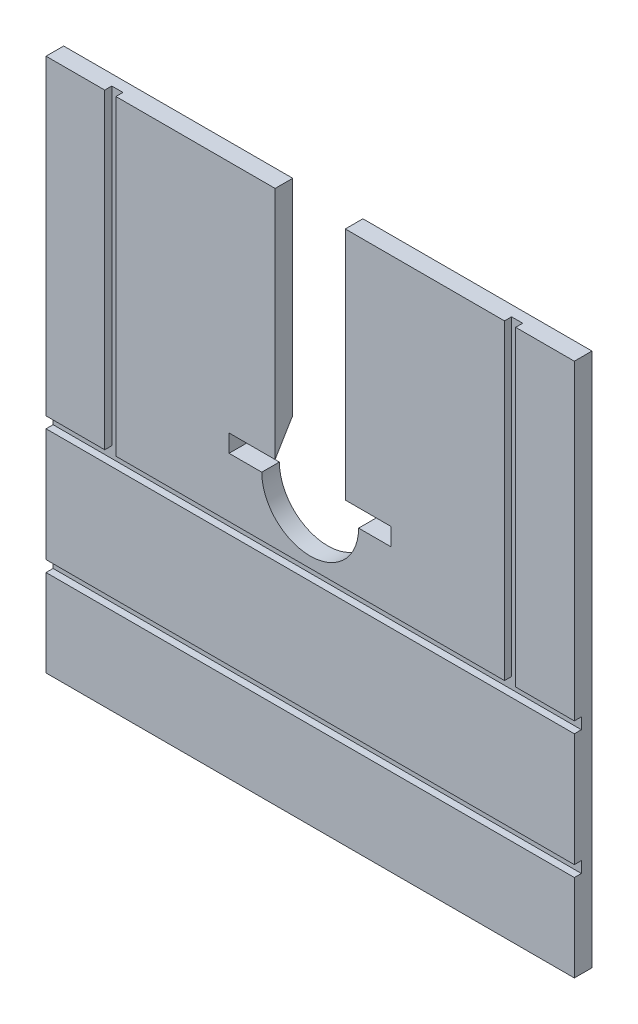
from build123d import *

# Parameters (mm, degrees)
ESTRUSIONE_ESTRUSIONE1_DEPTH = 30
SCHIZZO2_W                   = 900
SCHIZZO2_H                   = 19
TAGLIO_ESTRUSIONE1_DEPTH     = 12
SCHIZZO3_W                   = 900
SCHIZZO3_H                   = 19
TAGLIO_ESTRUSIONE3_DEPTH     = 12
TAGLIO_ESTRUSIONE7_DEPTH     = 23
TAGLIO_ESTRUSIONE8_DEPTH     = 23
SCHIZZO13_W                  = 19
SCHIZZO13_H                  = 530.709392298
TAGLIO_ESTRUSIONE9_DEPTH     = 12


with BuildPart() as part:
    # Schizzo1 → Estrusione-Estrusione1 (new body)
    with BuildSketch(Plane.XY):
        with BuildLine():
            Line((-59.776582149, 430), (-450, 430))
            Line((-450, 430), (-450, -480))
            Line((-450, -480), (450, -480))
            Line((450, -480), (450, 430))
            Line((450, 430), (59.776582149, 430))
            Line((59.776582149, 430), (59.776582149, 30))
            Line((59.776582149, 30), (137.776582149, 30))
            Line((137.776582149, 30), (137.776582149, 0))
            Line((137.776582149, 0), (82.5, 0))
            ThreePointArc((82.5, 0), (0, -82.5), (-82.5, 0))
            Line((-82.5, 0), (-138.223417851, 0))
            Line((-138.223417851, 0), (-138.223417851, 30))
            Line((-138.223417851, 30), (-59.776582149, 30))
            Line((-59.776582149, 30), (-59.776582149, 430))
        make_face()
    extrude(amount=ESTRUSIONE_ESTRUSIONE1_DEPTH)

    # Schizzo2 → Taglio-Estrusione1 (cut)
    with BuildSketch(Plane.XY.offset(30)):
        with Locations((0, -110.209392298)):
            Rectangle(SCHIZZO2_W, SCHIZZO2_H)
    extrude(amount=-TAGLIO_ESTRUSIONE1_DEPTH, mode=Mode.SUBTRACT)

    # Schizzo3 → Taglio-Estrusione3 (cut)
    with BuildSketch(Plane.XY.offset(30)):
        with Locations((0, -322.263041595)):
            Rectangle(SCHIZZO3_W, SCHIZZO3_H)
    extrude(amount=-TAGLIO_ESTRUSIONE3_DEPTH, mode=Mode.SUBTRACT)

    # Schizzo10 → Taglio-Estrusione7 (cut)
    with BuildSketch(Plane(origin=(-59.776582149, 0, 0), x_dir=(0, 0, -1), z_dir=(1, 0, 0))):
        Polygon((-30, 30), (0, 79.846843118), (0, 30), align=None)
    extrude(amount=-TAGLIO_ESTRUSIONE7_DEPTH, mode=Mode.SUBTRACT)

    # Schizzo12 → Taglio-Estrusione8 (cut)
    with BuildSketch(Plane.ZY.offset(-59.776582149)):
        Polygon((30, 30), (0, 79.846843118), (0, 30), align=None)
    extrude(amount=-TAGLIO_ESTRUSIONE8_DEPTH, mode=Mode.SUBTRACT)

    # Schizzo13 → Taglio-Estrusione9 (cut)
    with BuildSketch(Plane.XY.offset(30)):
        with Locations((-340.498590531, 164.645303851)):
            Rectangle(SCHIZZO13_W, SCHIZZO13_H)
        with Locations((340.498590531, 164.645303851)):
            Rectangle(SCHIZZO13_W, SCHIZZO13_H)
    extrude(amount=-TAGLIO_ESTRUSIONE9_DEPTH, mode=Mode.SUBTRACT)


solid = part.part
